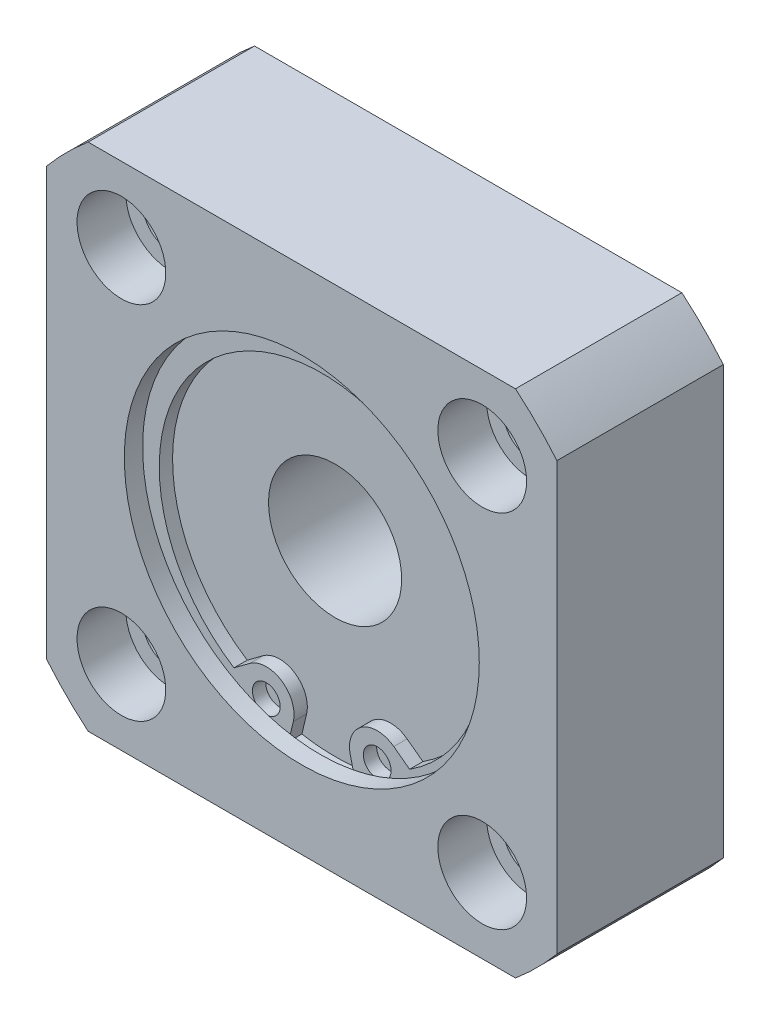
ISO-10303-21;
HEADER;
FILE_DESCRIPTION(('STEP AP214'),'2;1');
FILE_NAME('part.step','',(''),(''),'','','');
FILE_SCHEMA(('AUTOMOTIVE_DESIGN { 1 0 10303 214 1 1 1 1 }'));
ENDSEC;
DATA;
#1=APPLICATION_CONTEXT('core data for automotive mechanical design processes');
#2=APPLICATION_PROTOCOL_DEFINITION('international standard','automotive_design',2000,#1);
#3=PRODUCT_CONTEXT('',#1,'mechanical');
#4=PRODUCT('Part','Part','',(#3));
#5=PRODUCT_RELATED_PRODUCT_CATEGORY('part','',(#4));
#6=PRODUCT_DEFINITION_FORMATION('','',#4);
#7=PRODUCT_DEFINITION_CONTEXT('part definition',#1,'design');
#8=PRODUCT_DEFINITION('design','',#6,#7);
#9=PRODUCT_DEFINITION_SHAPE('','',#8);
#10=(LENGTH_UNIT() NAMED_UNIT(*) SI_UNIT(.MILLI.,.METRE.));
#11=(NAMED_UNIT(*) PLANE_ANGLE_UNIT() SI_UNIT($,.RADIAN.));
#12=(NAMED_UNIT(*) SI_UNIT($,.STERADIAN.) SOLID_ANGLE_UNIT());
#13=UNCERTAINTY_MEASURE_WITH_UNIT(LENGTH_MEASURE(1.E-05),#10,'distance_accuracy_value','');
#14=(GEOMETRIC_REPRESENTATION_CONTEXT(3) GLOBAL_UNCERTAINTY_ASSIGNED_CONTEXT((#13)) GLOBAL_UNIT_ASSIGNED_CONTEXT((#10,
#11,#12)) REPRESENTATION_CONTEXT('',''));
#15=CARTESIAN_POINT('',(0.,0.,0.));
#16=DIRECTION('',(0.,0.,1.));
#17=DIRECTION('',(1.,0.,0.));
#18=AXIS2_PLACEMENT_3D('',#15,#16,#17);
#19=CARTESIAN_POINT('',(0.,0.,12.));
#20=DIRECTION('',(0.,0.,1.));
#21=DIRECTION('',(1.,0.,0.));
#22=AXIS2_PLACEMENT_3D('',#19,#20,#21);
#23=PLANE('',#22);
#24=CARTESIAN_POINT('',(5.,-14.2233767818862,12.));
#25=DIRECTION('',(0.,0.,1.));
#26=DIRECTION('',(1.,0.,0.));
#27=AXIS2_PLACEMENT_3D('',#24,#25,#26);
#28=CIRCLE('',#27,1.25);
#29=CARTESIAN_POINT('',(6.25,-14.2233767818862,12.));
#30=VERTEX_POINT('',#29);
#31=EDGE_CURVE('E169',#30,#30,#28,.T.);
#32=ORIENTED_EDGE('',*,*,#31,.T.);
#33=EDGE_LOOP('',(#32));
#34=FACE_BOUND('',#33,.T.);
#35=ADVANCED_FACE('F14',(#34),#23,.T.);
#36=CARTESIAN_POINT('',(-5.,-14.2233767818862,12.));
#37=DIRECTION('',(0.,0.,-1.));
#38=DIRECTION('',(1.,0.,0.));
#39=AXIS2_PLACEMENT_3D('',#36,#37,#38);
#40=CIRCLE('',#39,1.25);
#41=CARTESIAN_POINT('',(-3.75,-14.2233767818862,12.));
#42=VERTEX_POINT('',#41);
#43=EDGE_CURVE('E179',#42,#42,#40,.T.);
#44=ORIENTED_EDGE('',*,*,#43,.F.);
#45=EDGE_LOOP('',(#44));
#46=FACE_BOUND('',#45,.T.);
#47=ADVANCED_FACE('F377',(#46),#23,.T.);
#48=CARTESIAN_POINT('',(16.2634559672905,16.2634559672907,10.6));
#49=DIRECTION('',(0.,0.,1.));
#50=DIRECTION('',(1.,0.,0.));
#51=AXIS2_PLACEMENT_3D('',#48,#49,#50);
#52=PLANE('',#51);
#53=CARTESIAN_POINT('',(16.2634559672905,16.2634559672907,10.6));
#54=DIRECTION('',(0.,0.,1.));
#55=DIRECTION('',(1.,0.,0.));
#56=AXIS2_PLACEMENT_3D('',#53,#54,#55);
#57=CIRCLE('',#56,4.);
#58=CARTESIAN_POINT('',(20.2634559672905,16.2634559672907,10.6));
#59=VERTEX_POINT('',#58);
#60=EDGE_CURVE('E274',#59,#59,#57,.T.);
#61=ORIENTED_EDGE('',*,*,#60,.T.);
#62=EDGE_LOOP('',(#61));
#63=FACE_BOUND('',#62,.T.);
#64=CARTESIAN_POINT('',(16.2634559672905,16.2634559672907,10.6));
#65=DIRECTION('',(0.,0.,1.));
#66=DIRECTION('',(1.,0.,0.));
#67=AXIS2_PLACEMENT_3D('',#64,#65,#66);
#68=CIRCLE('',#67,2.5);
#69=CARTESIAN_POINT('',(18.7634559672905,16.2634559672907,10.6));
#70=VERTEX_POINT('',#69);
#71=EDGE_CURVE('E277',#70,#70,#68,.F.);
#72=ORIENTED_EDGE('',*,*,#71,.T.);
#73=EDGE_LOOP('',(#72));
#74=FACE_BOUND('',#73,.T.);
#75=ADVANCED_FACE('F385',(#63,#74),#52,.T.);
#76=CARTESIAN_POINT('',(16.2634559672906,-16.2634559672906,10.6));
#77=DIRECTION('',(0.,0.,1.));
#78=DIRECTION('',(0.,-1.,0.));
#79=AXIS2_PLACEMENT_3D('',#76,#77,#78);
#80=PLANE('',#79);
#81=CARTESIAN_POINT('',(16.2634559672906,-16.2634559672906,10.6));
#82=DIRECTION('',(0.,0.,1.));
#83=DIRECTION('',(0.,-1.,0.));
#84=AXIS2_PLACEMENT_3D('',#81,#82,#83);
#85=CIRCLE('',#84,4.);
#86=CARTESIAN_POINT('',(16.2634559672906,-20.2634559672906,10.6));
#87=VERTEX_POINT('',#86);
#88=EDGE_CURVE('E258',#87,#87,#85,.T.);
#89=ORIENTED_EDGE('',*,*,#88,.T.);
#90=EDGE_LOOP('',(#89));
#91=FACE_BOUND('',#90,.T.);
#92=CARTESIAN_POINT('',(16.2634559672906,-16.2634559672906,10.6));
#93=DIRECTION('',(0.,0.,1.));
#94=DIRECTION('',(1.,0.,0.));
#95=AXIS2_PLACEMENT_3D('',#92,#93,#94);
#96=CIRCLE('',#95,2.5);
#97=CARTESIAN_POINT('',(18.7634559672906,-16.2634559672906,10.6));
#98=VERTEX_POINT('',#97);
#99=EDGE_CURVE('E261',#98,#98,#96,.F.);
#100=ORIENTED_EDGE('',*,*,#99,.T.);
#101=EDGE_LOOP('',(#100));
#102=FACE_BOUND('',#101,.T.);
#103=ADVANCED_FACE('F754',(#91,#102),#80,.T.);
#104=CARTESIAN_POINT('',(-16.2634559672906,-16.2634559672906,10.6));
#105=DIRECTION('',(0.,0.,1.));
#106=DIRECTION('',(-1.,0.,0.));
#107=AXIS2_PLACEMENT_3D('',#104,#105,#106);
#108=PLANE('',#107);
#109=CARTESIAN_POINT('',(-16.2634559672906,-16.2634559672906,10.6));
#110=DIRECTION('',(0.,0.,1.));
#111=DIRECTION('',(-1.,0.,0.));
#112=AXIS2_PLACEMENT_3D('',#109,#110,#111);
#113=CIRCLE('',#112,4.);
#114=CARTESIAN_POINT('',(-20.2634559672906,-16.2634559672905,10.6));
#115=VERTEX_POINT('',#114);
#116=EDGE_CURVE('E251',#115,#115,#113,.T.);
#117=ORIENTED_EDGE('',*,*,#116,.T.);
#118=EDGE_LOOP('',(#117));
#119=FACE_BOUND('',#118,.T.);
#120=CARTESIAN_POINT('',(-16.2634559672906,-16.2634559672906,10.6));
#121=DIRECTION('',(0.,0.,1.));
#122=DIRECTION('',(1.,0.,0.));
#123=AXIS2_PLACEMENT_3D('',#120,#121,#122);
#124=CIRCLE('',#123,2.5);
#125=CARTESIAN_POINT('',(-13.7634559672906,-16.2634559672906,10.6));
#126=VERTEX_POINT('',#125);
#127=EDGE_CURVE('E254',#126,#126,#124,.F.);
#128=ORIENTED_EDGE('',*,*,#127,.T.);
#129=EDGE_LOOP('',(#128));
#130=FACE_BOUND('',#129,.T.);
#131=ADVANCED_FACE('F744',(#119,#130),#108,.T.);
#132=CARTESIAN_POINT('',(-16.2634559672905,16.2634559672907,10.6));
#133=DIRECTION('',(0.,0.,1.));
#134=DIRECTION('',(0.,1.,0.));
#135=AXIS2_PLACEMENT_3D('',#132,#133,#134);
#136=PLANE('',#135);
#137=CARTESIAN_POINT('',(-16.2634559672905,16.2634559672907,10.6));
#138=DIRECTION('',(0.,0.,1.));
#139=DIRECTION('',(0.,1.,0.));
#140=AXIS2_PLACEMENT_3D('',#137,#138,#139);
#141=CIRCLE('',#140,4.);
#142=CARTESIAN_POINT('',(-16.2634559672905,20.2634559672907,10.6));
#143=VERTEX_POINT('',#142);
#144=EDGE_CURVE('E244',#143,#143,#141,.T.);
#145=ORIENTED_EDGE('',*,*,#144,.T.);
#146=EDGE_LOOP('',(#145));
#147=FACE_BOUND('',#146,.T.);
#148=CARTESIAN_POINT('',(-16.2634559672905,16.2634559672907,10.6));
#149=DIRECTION('',(0.,0.,1.));
#150=DIRECTION('',(1.,0.,0.));
#151=AXIS2_PLACEMENT_3D('',#148,#149,#150);
#152=CIRCLE('',#151,2.5);
#153=CARTESIAN_POINT('',(-13.7634559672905,16.2634559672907,10.6));
#154=VERTEX_POINT('',#153);
#155=EDGE_CURVE('E247',#154,#154,#152,.F.);
#156=ORIENTED_EDGE('',*,*,#155,.T.);
#157=EDGE_LOOP('',(#156));
#158=FACE_BOUND('',#157,.T.);
#159=ADVANCED_FACE('F734',(#147,#158),#136,.T.);
#160=CARTESIAN_POINT('',(16.2634559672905,16.2634559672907,0.));
#161=DIRECTION('',(0.,0.,1.));
#162=DIRECTION('',(1.,0.,0.));
#163=AXIS2_PLACEMENT_3D('',#160,#161,#162);
#164=CYLINDRICAL_SURFACE('',#163,2.5);
#165=CARTESIAN_POINT('',(16.2634559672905,16.2634559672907,0.));
#166=DIRECTION('',(0.,0.,1.));
#167=DIRECTION('',(1.,0.,0.));
#168=AXIS2_PLACEMENT_3D('',#165,#166,#167);
#169=CIRCLE('',#168,2.5);
#170=CARTESIAN_POINT('',(18.7634559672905,16.2634559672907,0.));
#171=VERTEX_POINT('',#170);
#172=EDGE_CURVE('E278',#171,#171,#169,.T.);
#173=ORIENTED_EDGE('',*,*,#172,.F.);
#174=EDGE_LOOP('',(#173));
#175=FACE_BOUND('',#174,.T.);
#176=ORIENTED_EDGE('',*,*,#71,.F.);
#177=EDGE_LOOP('',(#176));
#178=FACE_BOUND('',#177,.T.);
#179=ADVANCED_FACE('F724',(#175,#178),#164,.F.);
#180=CARTESIAN_POINT('',(16.2634559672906,-16.2634559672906,0.));
#181=DIRECTION('',(0.,0.,1.));
#182=DIRECTION('',(1.,0.,0.));
#183=AXIS2_PLACEMENT_3D('',#180,#181,#182);
#184=CYLINDRICAL_SURFACE('',#183,2.5);
#185=CARTESIAN_POINT('',(16.2634559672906,-16.2634559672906,0.));
#186=DIRECTION('',(0.,0.,1.));
#187=DIRECTION('',(0.,-1.,0.));
#188=AXIS2_PLACEMENT_3D('',#185,#186,#187);
#189=CIRCLE('',#188,2.5);
#190=CARTESIAN_POINT('',(16.2634559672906,-18.7634559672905,0.));
#191=VERTEX_POINT('',#190);
#192=EDGE_CURVE('E268',#191,#191,#189,.T.);
#193=ORIENTED_EDGE('',*,*,#192,.F.);
#194=EDGE_LOOP('',(#193));
#195=FACE_BOUND('',#194,.T.);
#196=ORIENTED_EDGE('',*,*,#99,.F.);
#197=EDGE_LOOP('',(#196));
#198=FACE_BOUND('',#197,.T.);
#199=ADVANCED_FACE('F714',(#195,#198),#184,.F.);
#200=CARTESIAN_POINT('',(-16.2634559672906,-16.2634559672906,0.));
#201=DIRECTION('',(0.,0.,1.));
#202=DIRECTION('',(1.,0.,0.));
#203=AXIS2_PLACEMENT_3D('',#200,#201,#202);
#204=CYLINDRICAL_SURFACE('',#203,2.5);
#205=CARTESIAN_POINT('',(-16.2634559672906,-16.2634559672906,0.));
#206=DIRECTION('',(0.,0.,1.));
#207=DIRECTION('',(-1.,0.,0.));
#208=AXIS2_PLACEMENT_3D('',#205,#206,#207);
#209=CIRCLE('',#208,2.5);
#210=CARTESIAN_POINT('',(-18.7634559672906,-16.2634559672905,0.));
#211=VERTEX_POINT('',#210);
#212=EDGE_CURVE('E265',#211,#211,#209,.T.);
#213=ORIENTED_EDGE('',*,*,#212,.F.);
#214=EDGE_LOOP('',(#213));
#215=FACE_BOUND('',#214,.T.);
#216=ORIENTED_EDGE('',*,*,#127,.F.);
#217=EDGE_LOOP('',(#216));
#218=FACE_BOUND('',#217,.T.);
#219=ADVANCED_FACE('F704',(#215,#218),#204,.F.);
#220=CARTESIAN_POINT('',(-16.2634559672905,16.2634559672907,0.));
#221=DIRECTION('',(0.,0.,1.));
#222=DIRECTION('',(1.,0.,0.));
#223=AXIS2_PLACEMENT_3D('',#220,#221,#222);
#224=CYLINDRICAL_SURFACE('',#223,2.5);
#225=CARTESIAN_POINT('',(-16.2634559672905,16.2634559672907,0.));
#226=DIRECTION('',(0.,0.,1.));
#227=DIRECTION('',(0.,1.,0.));
#228=AXIS2_PLACEMENT_3D('',#225,#226,#227);
#229=CIRCLE('',#228,2.5);
#230=CARTESIAN_POINT('',(-16.2634559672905,18.7634559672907,0.));
#231=VERTEX_POINT('',#230);
#232=EDGE_CURVE('E262',#231,#231,#229,.T.);
#233=ORIENTED_EDGE('',*,*,#232,.F.);
#234=EDGE_LOOP('',(#233));
#235=FACE_BOUND('',#234,.T.);
#236=ORIENTED_EDGE('',*,*,#155,.F.);
#237=EDGE_LOOP('',(#236));
#238=FACE_BOUND('',#237,.T.);
#239=ADVANCED_FACE('F694',(#235,#238),#224,.F.);
#240=CARTESIAN_POINT('',(-19.2613602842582,-23.,15.));
#241=DIRECTION('',(0.,1.,0.));
#242=DIRECTION('',(0.,0.,1.));
#243=AXIS2_PLACEMENT_3D('',#240,#241,#242);
#244=PLANE('',#243);
#245=DIRECTION('',(1.,0.,0.));
#246=VECTOR('',#245,1.);
#247=CARTESIAN_POINT('',(-19.2613602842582,-23.,15.));
#248=LINE('',#247,#246);
#249=CARTESIAN_POINT('',(-19.2613602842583,-23.,15.));
#250=VERTEX_POINT('',#249);
#251=CARTESIAN_POINT('',(19.2613602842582,-23.,15.));
#252=VERTEX_POINT('',#251);
#253=EDGE_CURVE('E306',#250,#252,#248,.T.);
#254=ORIENTED_EDGE('',*,*,#253,.F.);
#255=DIRECTION('',(0.,0.,-1.));
#256=VECTOR('',#255,1.);
#257=CARTESIAN_POINT('',(-19.2613602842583,-23.,15.));
#258=LINE('',#257,#256);
#259=CARTESIAN_POINT('',(-19.2613602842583,-23.,0.));
#260=VERTEX_POINT('',#259);
#261=EDGE_CURVE('E329',#250,#260,#258,.T.);
#262=ORIENTED_EDGE('',*,*,#261,.T.);
#263=DIRECTION('',(1.,0.,0.));
#264=VECTOR('',#263,1.);
#265=CARTESIAN_POINT('',(-19.2613602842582,-23.,0.));
#266=LINE('',#265,#264);
#267=CARTESIAN_POINT('',(19.2613602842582,-23.,0.));
#268=VERTEX_POINT('',#267);
#269=EDGE_CURVE('E284',#260,#268,#266,.T.);
#270=ORIENTED_EDGE('',*,*,#269,.T.);
#271=DIRECTION('',(0.,0.,-1.));
#272=VECTOR('',#271,1.);
#273=CARTESIAN_POINT('',(19.2613602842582,-23.,15.));
#274=LINE('',#273,#272);
#275=EDGE_CURVE('E327',#252,#268,#274,.T.);
#276=ORIENTED_EDGE('',*,*,#275,.F.);
#277=EDGE_LOOP('',(#254,#262,#270,#276));
#278=FACE_BOUND('',#277,.T.);
#279=ADVANCED_FACE('F684',(#278),#244,.F.);
#280=CARTESIAN_POINT('',(0.,0.,15.));
#281=DIRECTION('',(0.,0.,-1.));
#282=DIRECTION('',(-1.,0.,0.));
#283=AXIS2_PLACEMENT_3D('',#280,#281,#282);
#284=CYLINDRICAL_SURFACE('',#283,30.);
#285=ORIENTED_EDGE('',*,*,#261,.F.);
#286=CARTESIAN_POINT('',(0.,0.,15.));
#287=DIRECTION('',(0.,0.,1.));
#288=DIRECTION('',(1.,0.,0.));
#289=AXIS2_PLACEMENT_3D('',#286,#287,#288);
#290=CIRCLE('',#289,30.);
#291=CARTESIAN_POINT('',(-23.,-19.2613602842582,15.));
#292=VERTEX_POINT('',#291);
#293=EDGE_CURVE('E309',#292,#250,#290,.T.);
#294=ORIENTED_EDGE('',*,*,#293,.F.);
#295=DIRECTION('',(0.,0.,-1.));
#296=VECTOR('',#295,1.);
#297=CARTESIAN_POINT('',(-23.,-19.2613602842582,15.));
#298=LINE('',#297,#296);
#299=CARTESIAN_POINT('',(-23.,-19.2613602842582,0.));
#300=VERTEX_POINT('',#299);
#301=EDGE_CURVE('E331',#292,#300,#298,.T.);
#302=ORIENTED_EDGE('',*,*,#301,.T.);
#303=CARTESIAN_POINT('',(0.,0.,0.));
#304=DIRECTION('',(0.,0.,1.));
#305=DIRECTION('',(1.,0.,0.));
#306=AXIS2_PLACEMENT_3D('',#303,#304,#305);
#307=CIRCLE('',#306,30.);
#308=EDGE_CURVE('E287',#300,#260,#307,.T.);
#309=ORIENTED_EDGE('',*,*,#308,.T.);
#310=EDGE_LOOP('',(#285,#294,#302,#309));
#311=FACE_BOUND('',#310,.T.);
#312=ADVANCED_FACE('F674',(#311),#284,.T.);
#313=CARTESIAN_POINT('',(-23.,-19.2613602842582,15.));
#314=DIRECTION('',(-1.,0.,0.));
#315=DIRECTION('',(0.,0.,1.));
#316=AXIS2_PLACEMENT_3D('',#313,#314,#315);
#317=PLANE('',#316);
#318=ORIENTED_EDGE('',*,*,#301,.F.);
#319=DIRECTION('',(0.,1.,0.));
#320=VECTOR('',#319,1.);
#321=CARTESIAN_POINT('',(-23.,-19.2613602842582,15.));
#322=LINE('',#321,#320);
#323=CARTESIAN_POINT('',(-23.,19.2613602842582,15.));
#324=VERTEX_POINT('',#323);
#325=EDGE_CURVE('E312',#292,#324,#322,.T.);
#326=ORIENTED_EDGE('',*,*,#325,.T.);
#327=DIRECTION('',(0.,0.,-1.));
#328=VECTOR('',#327,1.);
#329=CARTESIAN_POINT('',(-23.,19.2613602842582,15.));
#330=LINE('',#329,#328);
#331=CARTESIAN_POINT('',(-23.,19.2613602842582,0.));
#332=VERTEX_POINT('',#331);
#333=EDGE_CURVE('E333',#324,#332,#330,.T.);
#334=ORIENTED_EDGE('',*,*,#333,.T.);
#335=DIRECTION('',(0.,1.,0.));
#336=VECTOR('',#335,1.);
#337=CARTESIAN_POINT('',(-23.,-19.2613602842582,0.));
#338=LINE('',#337,#336);
#339=EDGE_CURVE('E290',#300,#332,#338,.T.);
#340=ORIENTED_EDGE('',*,*,#339,.F.);
#341=EDGE_LOOP('',(#318,#326,#334,#340));
#342=FACE_BOUND('',#341,.T.);
#343=ADVANCED_FACE('F664',(#342),#317,.T.);
#344=CARTESIAN_POINT('',(0.,0.,15.));
#345=DIRECTION('',(0.,0.,-1.));
#346=DIRECTION('',(-1.,0.,0.));
#347=AXIS2_PLACEMENT_3D('',#344,#345,#346);
#348=CYLINDRICAL_SURFACE('',#347,30.);
#349=ORIENTED_EDGE('',*,*,#333,.F.);
#350=CARTESIAN_POINT('',(0.,0.,15.));
#351=DIRECTION('',(0.,0.,-1.));
#352=DIRECTION('',(-1.,0.,0.));
#353=AXIS2_PLACEMENT_3D('',#350,#351,#352);
#354=CIRCLE('',#353,30.);
#355=CARTESIAN_POINT('',(-19.2613602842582,23.,15.));
#356=VERTEX_POINT('',#355);
#357=EDGE_CURVE('E315',#324,#356,#354,.T.);
#358=ORIENTED_EDGE('',*,*,#357,.T.);
#359=DIRECTION('',(0.,0.,-1.));
#360=VECTOR('',#359,1.);
#361=CARTESIAN_POINT('',(-19.2613602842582,23.,15.));
#362=LINE('',#361,#360);
#363=CARTESIAN_POINT('',(-19.2613602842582,23.,0.));
#364=VERTEX_POINT('',#363);
#365=EDGE_CURVE('E335',#356,#364,#362,.T.);
#366=ORIENTED_EDGE('',*,*,#365,.T.);
#367=CARTESIAN_POINT('',(0.,0.,0.));
#368=DIRECTION('',(0.,0.,-1.));
#369=DIRECTION('',(-1.,0.,0.));
#370=AXIS2_PLACEMENT_3D('',#367,#368,#369);
#371=CIRCLE('',#370,30.);
#372=EDGE_CURVE('E293',#332,#364,#371,.T.);
#373=ORIENTED_EDGE('',*,*,#372,.F.);
#374=EDGE_LOOP('',(#349,#358,#366,#373));
#375=FACE_BOUND('',#374,.T.);
#376=ADVANCED_FACE('F654',(#375),#348,.T.);
#377=CARTESIAN_POINT('',(-19.2613602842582,23.,15.));
#378=DIRECTION('',(0.,1.,0.));
#379=DIRECTION('',(0.,0.,1.));
#380=AXIS2_PLACEMENT_3D('',#377,#378,#379);
#381=PLANE('',#380);
#382=ORIENTED_EDGE('',*,*,#365,.F.);
#383=DIRECTION('',(1.,0.,0.));
#384=VECTOR('',#383,1.);
#385=CARTESIAN_POINT('',(-19.2613602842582,23.,15.));
#386=LINE('',#385,#384);
#387=CARTESIAN_POINT('',(19.2613602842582,23.,15.));
#388=VERTEX_POINT('',#387);
#389=EDGE_CURVE('E318',#356,#388,#386,.T.);
#390=ORIENTED_EDGE('',*,*,#389,.T.);
#391=DIRECTION('',(0.,0.,-1.));
#392=VECTOR('',#391,1.);
#393=CARTESIAN_POINT('',(19.2613602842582,23.,15.));
#394=LINE('',#393,#392);
#395=CARTESIAN_POINT('',(19.2613602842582,23.,0.));
#396=VERTEX_POINT('',#395);
#397=EDGE_CURVE('E337',#388,#396,#394,.T.);
#398=ORIENTED_EDGE('',*,*,#397,.T.);
#399=DIRECTION('',(1.,0.,0.));
#400=VECTOR('',#399,1.);
#401=CARTESIAN_POINT('',(-19.2613602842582,23.,0.));
#402=LINE('',#401,#400);
#403=EDGE_CURVE('E296',#364,#396,#402,.T.);
#404=ORIENTED_EDGE('',*,*,#403,.F.);
#405=EDGE_LOOP('',(#382,#390,#398,#404));
#406=FACE_BOUND('',#405,.T.);
#407=ADVANCED_FACE('F645',(#406),#381,.T.);
#408=CARTESIAN_POINT('',(0.,0.,15.));
#409=DIRECTION('',(0.,0.,-1.));
#410=DIRECTION('',(-1.,0.,0.));
#411=AXIS2_PLACEMENT_3D('',#408,#409,#410);
#412=CYLINDRICAL_SURFACE('',#411,30.);
#413=ORIENTED_EDGE('',*,*,#397,.F.);
#414=CARTESIAN_POINT('',(0.,0.,15.));
#415=DIRECTION('',(0.,0.,1.));
#416=DIRECTION('',(1.,0.,0.));
#417=AXIS2_PLACEMENT_3D('',#414,#415,#416);
#418=CIRCLE('',#417,30.);
#419=CARTESIAN_POINT('',(23.,19.2613602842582,15.));
#420=VERTEX_POINT('',#419);
#421=EDGE_CURVE('E321',#420,#388,#418,.T.);
#422=ORIENTED_EDGE('',*,*,#421,.F.);
#423=DIRECTION('',(0.,0.,-1.));
#424=VECTOR('',#423,1.);
#425=CARTESIAN_POINT('',(23.,19.2613602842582,15.));
#426=LINE('',#425,#424);
#427=CARTESIAN_POINT('',(23.,19.2613602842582,0.));
#428=VERTEX_POINT('',#427);
#429=EDGE_CURVE('E82',#420,#428,#426,.T.);
#430=ORIENTED_EDGE('',*,*,#429,.T.);
#431=CARTESIAN_POINT('',(0.,0.,0.));
#432=DIRECTION('',(0.,0.,1.));
#433=DIRECTION('',(1.,0.,0.));
#434=AXIS2_PLACEMENT_3D('',#431,#432,#433);
#435=CIRCLE('',#434,30.);
#436=EDGE_CURVE('E299',#428,#396,#435,.T.);
#437=ORIENTED_EDGE('',*,*,#436,.T.);
#438=EDGE_LOOP('',(#413,#422,#430,#437));
#439=FACE_BOUND('',#438,.T.);
#440=ADVANCED_FACE('F637',(#439),#412,.T.);
#441=CARTESIAN_POINT('',(23.,-19.2613602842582,15.));
#442=DIRECTION('',(-1.,0.,0.));
#443=DIRECTION('',(0.,0.,1.));
#444=AXIS2_PLACEMENT_3D('',#441,#442,#443);
#445=PLANE('',#444);
#446=ORIENTED_EDGE('',*,*,#429,.F.);
#447=DIRECTION('',(0.,1.,0.));
#448=VECTOR('',#447,1.);
#449=CARTESIAN_POINT('',(23.,-19.2613602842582,15.));
#450=LINE('',#449,#448);
#451=CARTESIAN_POINT('',(23.,-19.2613602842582,15.));
#452=VERTEX_POINT('',#451);
#453=EDGE_CURVE('E324',#452,#420,#450,.T.);
#454=ORIENTED_EDGE('',*,*,#453,.F.);
#455=DIRECTION('',(0.,0.,-1.));
#456=VECTOR('',#455,1.);
#457=CARTESIAN_POINT('',(23.,-19.2613602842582,15.));
#458=LINE('',#457,#456);
#459=CARTESIAN_POINT('',(23.,-19.2613602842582,0.));
#460=VERTEX_POINT('',#459);
#461=EDGE_CURVE('E89',#452,#460,#458,.T.);
#462=ORIENTED_EDGE('',*,*,#461,.T.);
#463=DIRECTION('',(0.,1.,0.));
#464=VECTOR('',#463,1.);
#465=CARTESIAN_POINT('',(23.,-19.2613602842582,0.));
#466=LINE('',#465,#464);
#467=EDGE_CURVE('E302',#460,#428,#466,.T.);
#468=ORIENTED_EDGE('',*,*,#467,.T.);
#469=EDGE_LOOP('',(#446,#454,#462,#468));
#470=FACE_BOUND('',#469,.T.);
#471=ADVANCED_FACE('F16',(#470),#445,.F.);
#472=CARTESIAN_POINT('',(0.,0.,15.));
#473=DIRECTION('',(0.,0.,-1.));
#474=DIRECTION('',(-1.,0.,0.));
#475=AXIS2_PLACEMENT_3D('',#472,#473,#474);
#476=CYLINDRICAL_SURFACE('',#475,30.);
#477=ORIENTED_EDGE('',*,*,#461,.F.);
#478=CARTESIAN_POINT('',(0.,0.,15.));
#479=DIRECTION('',(0.,0.,-1.));
#480=DIRECTION('',(-1.,0.,0.));
#481=AXIS2_PLACEMENT_3D('',#478,#479,#480);
#482=CIRCLE('',#481,30.);
#483=EDGE_CURVE('E304',#452,#252,#482,.T.);
#484=ORIENTED_EDGE('',*,*,#483,.T.);
#485=ORIENTED_EDGE('',*,*,#275,.T.);
#486=CARTESIAN_POINT('',(0.,0.,0.));
#487=DIRECTION('',(0.,0.,-1.));
#488=DIRECTION('',(-1.,0.,0.));
#489=AXIS2_PLACEMENT_3D('',#486,#487,#488);
#490=CIRCLE('',#489,30.);
#491=EDGE_CURVE('E281',#460,#268,#490,.T.);
#492=ORIENTED_EDGE('',*,*,#491,.F.);
#493=EDGE_LOOP('',(#477,#484,#485,#492));
#494=FACE_BOUND('',#493,.T.);
#495=ADVANCED_FACE('F619',(#494),#476,.T.);
#496=CARTESIAN_POINT('',(16.2634559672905,16.2634559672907,10.6));
#497=DIRECTION('',(0.,0.,1.));
#498=DIRECTION('',(1.,0.,0.));
#499=AXIS2_PLACEMENT_3D('',#496,#497,#498);
#500=CYLINDRICAL_SURFACE('',#499,4.);
#501=ORIENTED_EDGE('',*,*,#60,.F.);
#502=EDGE_LOOP('',(#501));
#503=FACE_BOUND('',#502,.T.);
#504=CARTESIAN_POINT('',(16.2634559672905,16.2634559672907,15.));
#505=DIRECTION('',(0.,0.,1.));
#506=DIRECTION('',(1.,0.,0.));
#507=AXIS2_PLACEMENT_3D('',#504,#505,#506);
#508=CIRCLE('',#507,4.);
#509=CARTESIAN_POINT('',(20.2634559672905,16.2634559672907,15.));
#510=VERTEX_POINT('',#509);
#511=EDGE_CURVE('E271',#510,#510,#508,.T.);
#512=ORIENTED_EDGE('',*,*,#511,.T.);
#513=EDGE_LOOP('',(#512));
#514=FACE_BOUND('',#513,.T.);
#515=ADVANCED_FACE('F609',(#503,#514),#500,.F.);
#516=CARTESIAN_POINT('',(16.2634559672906,-16.2634559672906,10.6));
#517=DIRECTION('',(0.,0.,1.));
#518=DIRECTION('',(1.,0.,0.));
#519=AXIS2_PLACEMENT_3D('',#516,#517,#518);
#520=CYLINDRICAL_SURFACE('',#519,4.);
#521=ORIENTED_EDGE('',*,*,#88,.F.);
#522=EDGE_LOOP('',(#521));
#523=FACE_BOUND('',#522,.T.);
#524=CARTESIAN_POINT('',(16.2634559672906,-16.2634559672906,15.));
#525=DIRECTION('',(0.,0.,1.));
#526=DIRECTION('',(0.,-1.,0.));
#527=AXIS2_PLACEMENT_3D('',#524,#525,#526);
#528=CIRCLE('',#527,4.);
#529=CARTESIAN_POINT('',(16.2634559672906,-20.2634559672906,15.));
#530=VERTEX_POINT('',#529);
#531=EDGE_CURVE('E255',#530,#530,#528,.T.);
#532=ORIENTED_EDGE('',*,*,#531,.T.);
#533=EDGE_LOOP('',(#532));
#534=FACE_BOUND('',#533,.T.);
#535=ADVANCED_FACE('F599',(#523,#534),#520,.F.);
#536=CARTESIAN_POINT('',(-16.2634559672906,-16.2634559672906,10.6));
#537=DIRECTION('',(0.,0.,1.));
#538=DIRECTION('',(1.,0.,0.));
#539=AXIS2_PLACEMENT_3D('',#536,#537,#538);
#540=CYLINDRICAL_SURFACE('',#539,4.);
#541=ORIENTED_EDGE('',*,*,#116,.F.);
#542=EDGE_LOOP('',(#541));
#543=FACE_BOUND('',#542,.T.);
#544=CARTESIAN_POINT('',(-16.2634559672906,-16.2634559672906,15.));
#545=DIRECTION('',(0.,0.,1.));
#546=DIRECTION('',(-1.,0.,0.));
#547=AXIS2_PLACEMENT_3D('',#544,#545,#546);
#548=CIRCLE('',#547,4.);
#549=CARTESIAN_POINT('',(-20.2634559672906,-16.2634559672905,15.));
#550=VERTEX_POINT('',#549);
#551=EDGE_CURVE('E248',#550,#550,#548,.T.);
#552=ORIENTED_EDGE('',*,*,#551,.T.);
#553=EDGE_LOOP('',(#552));
#554=FACE_BOUND('',#553,.T.);
#555=ADVANCED_FACE('F589',(#543,#554),#540,.F.);
#556=CARTESIAN_POINT('',(-16.2634559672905,16.2634559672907,10.6));
#557=DIRECTION('',(0.,0.,1.));
#558=DIRECTION('',(1.,0.,0.));
#559=AXIS2_PLACEMENT_3D('',#556,#557,#558);
#560=CYLINDRICAL_SURFACE('',#559,4.);
#561=ORIENTED_EDGE('',*,*,#144,.F.);
#562=EDGE_LOOP('',(#561));
#563=FACE_BOUND('',#562,.T.);
#564=CARTESIAN_POINT('',(-16.2634559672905,16.2634559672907,15.));
#565=DIRECTION('',(0.,0.,1.));
#566=DIRECTION('',(0.,1.,0.));
#567=AXIS2_PLACEMENT_3D('',#564,#565,#566);
#568=CIRCLE('',#567,4.);
#569=CARTESIAN_POINT('',(-16.2634559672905,20.2634559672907,15.));
#570=VERTEX_POINT('',#569);
#571=EDGE_CURVE('E241',#570,#570,#568,.T.);
#572=ORIENTED_EDGE('',*,*,#571,.T.);
#573=EDGE_LOOP('',(#572));
#574=FACE_BOUND('',#573,.T.);
#575=ADVANCED_FACE('F579',(#563,#574),#560,.F.);
#576=CARTESIAN_POINT('',(0.,0.,0.));
#577=DIRECTION('',(0.,0.,-1.));
#578=DIRECTION('',(-1.,0.,0.));
#579=AXIS2_PLACEMENT_3D('',#576,#577,#578);
#580=PLANE('',#579);
#581=CARTESIAN_POINT('',(0.,0.,0.));
#582=DIRECTION('',(0.,0.,-1.));
#583=DIRECTION('',(-1.,0.,0.));
#584=AXIS2_PLACEMENT_3D('',#581,#582,#583);
#585=CIRCLE('',#584,13.);
#586=CARTESIAN_POINT('',(-13.,0.,0.));
#587=VERTEX_POINT('',#586);
#588=EDGE_CURVE('E230',#587,#587,#585,.T.);
#589=ORIENTED_EDGE('',*,*,#588,.F.);
#590=EDGE_LOOP('',(#589));
#591=FACE_BOUND('',#590,.T.);
#592=ORIENTED_EDGE('',*,*,#232,.T.);
#593=EDGE_LOOP('',(#592));
#594=FACE_BOUND('',#593,.T.);
#595=ORIENTED_EDGE('',*,*,#212,.T.);
#596=EDGE_LOOP('',(#595));
#597=FACE_BOUND('',#596,.T.);
#598=ORIENTED_EDGE('',*,*,#192,.T.);
#599=EDGE_LOOP('',(#598));
#600=FACE_BOUND('',#599,.T.);
#601=ORIENTED_EDGE('',*,*,#172,.T.);
#602=EDGE_LOOP('',(#601));
#603=FACE_BOUND('',#602,.T.);
#604=ORIENTED_EDGE('',*,*,#491,.T.);
#605=ORIENTED_EDGE('',*,*,#269,.F.);
#606=ORIENTED_EDGE('',*,*,#308,.F.);
#607=ORIENTED_EDGE('',*,*,#339,.T.);
#608=ORIENTED_EDGE('',*,*,#372,.T.);
#609=ORIENTED_EDGE('',*,*,#403,.T.);
#610=ORIENTED_EDGE('',*,*,#436,.F.);
#611=ORIENTED_EDGE('',*,*,#467,.F.);
#612=EDGE_LOOP('',(#604,#605,#606,#607,#608,#609,#610,#611));
#613=FACE_BOUND('',#612,.T.);
#614=ADVANCED_FACE('F569',(#591,#594,#597,#600,#603,#613),#580,.T.);
#615=CARTESIAN_POINT('',(0.,0.,15.));
#616=DIRECTION('',(0.,0.,-1.));
#617=DIRECTION('',(-1.,0.,0.));
#618=AXIS2_PLACEMENT_3D('',#615,#616,#617);
#619=PLANE('',#618);
#620=CARTESIAN_POINT('',(0.,0.,15.));
#621=DIRECTION('',(0.,0.,1.));
#622=DIRECTION('',(1.,0.,0.));
#623=AXIS2_PLACEMENT_3D('',#620,#621,#622);
#624=CIRCLE('',#623,16.);
#625=CARTESIAN_POINT('',(16.,0.,15.));
#626=VERTEX_POINT('',#625);
#627=EDGE_CURVE('E237',#626,#626,#624,.T.);
#628=ORIENTED_EDGE('',*,*,#627,.F.);
#629=EDGE_LOOP('',(#628));
#630=FACE_BOUND('',#629,.T.);
#631=ORIENTED_EDGE('',*,*,#571,.F.);
#632=EDGE_LOOP('',(#631));
#633=FACE_BOUND('',#632,.T.);
#634=ORIENTED_EDGE('',*,*,#551,.F.);
#635=EDGE_LOOP('',(#634));
#636=FACE_BOUND('',#635,.T.);
#637=ORIENTED_EDGE('',*,*,#531,.F.);
#638=EDGE_LOOP('',(#637));
#639=FACE_BOUND('',#638,.T.);
#640=ORIENTED_EDGE('',*,*,#511,.F.);
#641=EDGE_LOOP('',(#640));
#642=FACE_BOUND('',#641,.T.);
#643=ORIENTED_EDGE('',*,*,#483,.F.);
#644=ORIENTED_EDGE('',*,*,#453,.T.);
#645=ORIENTED_EDGE('',*,*,#421,.T.);
#646=ORIENTED_EDGE('',*,*,#389,.F.);
#647=ORIENTED_EDGE('',*,*,#357,.F.);
#648=ORIENTED_EDGE('',*,*,#325,.F.);
#649=ORIENTED_EDGE('',*,*,#293,.T.);
#650=ORIENTED_EDGE('',*,*,#253,.T.);
#651=EDGE_LOOP('',(#643,#644,#645,#646,#647,#648,#649,#650));
#652=FACE_BOUND('',#651,.T.);
#653=ADVANCED_FACE('F560',(#630,#633,#636,#639,#642,#652),#619,.F.);
#654=CARTESIAN_POINT('',(0.,0.,2.));
#655=DIRECTION('',(0.,0.,-1.));
#656=DIRECTION('',(-1.,0.,0.));
#657=AXIS2_PLACEMENT_3D('',#654,#655,#656);
#658=CYLINDRICAL_SURFACE('',#657,13.);
#659=CARTESIAN_POINT('',(0.,0.,2.));
#660=DIRECTION('',(0.,0.,-1.));
#661=DIRECTION('',(-1.,0.,0.));
#662=AXIS2_PLACEMENT_3D('',#659,#660,#661);
#663=CIRCLE('',#662,13.);
#664=CARTESIAN_POINT('',(-13.,0.,2.));
#665=VERTEX_POINT('',#664);
#666=EDGE_CURVE('E233',#665,#665,#663,.T.);
#667=ORIENTED_EDGE('',*,*,#666,.F.);
#668=EDGE_LOOP('',(#667));
#669=FACE_BOUND('',#668,.T.);
#670=ORIENTED_EDGE('',*,*,#588,.T.);
#671=EDGE_LOOP('',(#670));
#672=FACE_BOUND('',#671,.T.);
#673=ADVANCED_FACE('F552',(#669,#672),#658,.F.);
#674=CARTESIAN_POINT('',(0.,0.,12.));
#675=DIRECTION('',(0.,0.,1.));
#676=DIRECTION('',(1.,0.,0.));
#677=AXIS2_PLACEMENT_3D('',#674,#675,#676);
#678=CYLINDRICAL_SURFACE('',#677,16.);
#679=CARTESIAN_POINT('',(0.,0.,13.35));
#680=DIRECTION('',(0.,0.,1.));
#681=DIRECTION('',(1.,0.,0.));
#682=AXIS2_PLACEMENT_3D('',#679,#680,#681);
#683=CIRCLE('',#682,16.);
#684=CARTESIAN_POINT('',(16.,0.,13.35));
#685=VERTEX_POINT('',#684);
#686=EDGE_CURVE('E228',#685,#685,#683,.F.);
#687=ORIENTED_EDGE('',*,*,#686,.T.);
#688=EDGE_LOOP('',(#687));
#689=FACE_BOUND('',#688,.T.);
#690=ORIENTED_EDGE('',*,*,#627,.T.);
#691=EDGE_LOOP('',(#690));
#692=FACE_BOUND('',#691,.T.);
#693=ADVANCED_FACE('F356',(#689,#692),#678,.F.);
#694=CARTESIAN_POINT('',(0.,0.,2.));
#695=DIRECTION('',(0.,0.,-1.));
#696=DIRECTION('',(-1.,0.,0.));
#697=AXIS2_PLACEMENT_3D('',#694,#695,#696);
#698=PLANE('',#697);
#699=CARTESIAN_POINT('',(0.,0.,2.));
#700=DIRECTION('',(0.,0.,-1.));
#701=DIRECTION('',(-1.,0.,0.));
#702=AXIS2_PLACEMENT_3D('',#699,#700,#701);
#703=CIRCLE('',#702,6.);
#704=CARTESIAN_POINT('',(-6.,0.,2.));
#705=VERTEX_POINT('',#704);
#706=EDGE_CURVE('E236',#705,#705,#703,.T.);
#707=ORIENTED_EDGE('',*,*,#706,.F.);
#708=EDGE_LOOP('',(#707));
#709=FACE_BOUND('',#708,.T.);
#710=ORIENTED_EDGE('',*,*,#666,.T.);
#711=EDGE_LOOP('',(#710));
#712=FACE_BOUND('',#711,.T.);
#713=ADVANCED_FACE('F361',(#709,#712),#698,.T.);
#714=CARTESIAN_POINT('',(0.,0.,13.35));
#715=DIRECTION('',(0.,0.,1.));
#716=DIRECTION('',(1.,0.,0.));
#717=AXIS2_PLACEMENT_3D('',#714,#715,#716);
#718=PLANE('',#717);
#719=CARTESIAN_POINT('',(0.,0.,13.35));
#720=DIRECTION('',(0.,0.,1.));
#721=DIRECTION('',(1.,0.,0.));
#722=AXIS2_PLACEMENT_3D('',#719,#720,#721);
#723=CIRCLE('',#722,16.85);
#724=CARTESIAN_POINT('',(16.85,0.,13.35));
#725=VERTEX_POINT('',#724);
#726=EDGE_CURVE('E225',#725,#725,#723,.T.);
#727=ORIENTED_EDGE('',*,*,#726,.F.);
#728=EDGE_LOOP('',(#727));
#729=FACE_BOUND('',#728,.T.);
#730=ORIENTED_EDGE('',*,*,#686,.F.);
#731=EDGE_LOOP('',(#730));
#732=FACE_BOUND('',#731,.T.);
#733=ADVANCED_FACE('F359',(#729,#732),#718,.F.);
#734=CARTESIAN_POINT('',(0.,0.,13.35));
#735=DIRECTION('',(0.,0.,-1.));
#736=DIRECTION('',(-1.,0.,0.));
#737=AXIS2_PLACEMENT_3D('',#734,#735,#736);
#738=CYLINDRICAL_SURFACE('',#737,16.85);
#739=ORIENTED_EDGE('',*,*,#726,.T.);
#740=EDGE_LOOP('',(#739));
#741=FACE_BOUND('',#740,.T.);
#742=DIRECTION('',(0.,0.,-1.));
#743=VECTOR('',#742,1.);
#744=CARTESIAN_POINT('',(2.99125499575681,-16.5823669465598,13.35));
#745=LINE('',#744,#743);
#746=CARTESIAN_POINT('',(2.99125499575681,-16.5823669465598,12.));
#747=VERTEX_POINT('',#746);
#748=CARTESIAN_POINT('',(2.99125499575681,-16.5823669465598,13.2));
#749=VERTEX_POINT('',#748);
#750=EDGE_CURVE('E18',#747,#749,#745,.F.);
#751=ORIENTED_EDGE('',*,*,#750,.F.);
#752=CARTESIAN_POINT('',(0.,0.,12.));
#753=DIRECTION('',(0.,0.,1.));
#754=DIRECTION('',(1.,0.,0.));
#755=AXIS2_PLACEMENT_3D('',#752,#753,#754);
#756=CIRCLE('',#755,16.85);
#757=CARTESIAN_POINT('',(-2.99125499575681,-16.5823669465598,12.));
#758=VERTEX_POINT('',#757);
#759=EDGE_CURVE('E137',#758,#747,#756,.T.);
#760=ORIENTED_EDGE('',*,*,#759,.F.);
#761=DIRECTION('',(0.,0.,-1.));
#762=VECTOR('',#761,1.);
#763=CARTESIAN_POINT('',(-2.99125499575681,-16.5823669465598,13.35));
#764=LINE('',#763,#762);
#765=CARTESIAN_POINT('',(-2.99125499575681,-16.5823669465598,13.2));
#766=VERTEX_POINT('',#765);
#767=EDGE_CURVE('E134',#766,#758,#764,.T.);
#768=ORIENTED_EDGE('',*,*,#767,.F.);
#769=CARTESIAN_POINT('',(0.,0.,13.2));
#770=DIRECTION('',(0.,0.,-1.));
#771=DIRECTION('',(-1.,0.,0.));
#772=AXIS2_PLACEMENT_3D('',#769,#770,#771);
#773=CIRCLE('',#772,16.85);
#774=EDGE_CURVE('E9',#749,#766,#773,.F.);
#775=ORIENTED_EDGE('',*,*,#774,.F.);
#776=EDGE_LOOP('',(#751,#760,#768,#775));
#777=FACE_BOUND('',#776,.T.);
#778=ADVANCED_FACE('F135',(#741,#777),#738,.F.);
#779=CARTESIAN_POINT('',(0.,0.,15.));
#780=DIRECTION('',(0.,0.,-1.));
#781=DIRECTION('',(-1.,0.,0.));
#782=AXIS2_PLACEMENT_3D('',#779,#780,#781);
#783=CYLINDRICAL_SURFACE('',#782,6.);
#784=CARTESIAN_POINT('',(0.,0.,12.));
#785=DIRECTION('',(0.,0.,1.));
#786=DIRECTION('',(1.,0.,0.));
#787=AXIS2_PLACEMENT_3D('',#784,#785,#786);
#788=CIRCLE('',#787,6.);
#789=CARTESIAN_POINT('',(6.,0.,12.));
#790=VERTEX_POINT('',#789);
#791=EDGE_CURVE('E240',#790,#790,#788,.T.);
#792=ORIENTED_EDGE('',*,*,#791,.T.);
#793=EDGE_LOOP('',(#792));
#794=FACE_BOUND('',#793,.T.);
#795=ORIENTED_EDGE('',*,*,#706,.T.);
#796=EDGE_LOOP('',(#795));
#797=FACE_BOUND('',#796,.T.);
#798=ADVANCED_FACE('F369',(#794,#797),#783,.F.);
#799=ORIENTED_EDGE('',*,*,#791,.F.);
#800=EDGE_LOOP('',(#799));
#801=FACE_BOUND('',#800,.T.);
#802=DIRECTION('',(0.231349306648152,-0.972870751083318,0.));
#803=VECTOR('',#802,1.);
#804=CARTESIAN_POINT('',(2.5678231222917,-14.8017500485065,12.));
#805=LINE('',#804,#803);
#806=CARTESIAN_POINT('',(2.5678231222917,-14.8017500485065,12.));
#807=VERTEX_POINT('',#806);
#808=EDGE_CURVE('E185',#807,#747,#805,.T.);
#809=ORIENTED_EDGE('',*,*,#808,.F.);
#810=CARTESIAN_POINT('',(5.,-14.2233767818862,12.));
#811=DIRECTION('',(0.,0.,1.));
#812=DIRECTION('',(1.,0.,0.));
#813=AXIS2_PLACEMENT_3D('',#810,#811,#812);
#814=CIRCLE('',#813,2.5);
#815=CARTESIAN_POINT('',(6.49138441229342,-12.2169439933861,12.));
#816=VERTEX_POINT('',#815);
#817=EDGE_CURVE('E184',#816,#807,#814,.T.);
#818=ORIENTED_EDGE('',*,*,#817,.F.);
#819=DIRECTION('',(-0.802573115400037,0.596553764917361,0.));
#820=VECTOR('',#819,1.);
#821=CARTESIAN_POINT('',(6.49138441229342,-12.2169439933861,12.));
#822=LINE('',#821,#820);
#823=CARTESIAN_POINT('',(7.91695293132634,-13.2765711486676,12.));
#824=VERTEX_POINT('',#823);
#825=EDGE_CURVE('E197',#824,#816,#822,.T.);
#826=ORIENTED_EDGE('',*,*,#825,.F.);
#827=CARTESIAN_POINT('',(0.,-0.95,12.));
#828=DIRECTION('',(0.,0.,-1.));
#829=DIRECTION('',(0.,-1.,0.));
#830=AXIS2_PLACEMENT_3D('',#827,#828,#829);
#831=CIRCLE('',#830,14.65);
#832=CARTESIAN_POINT('',(-7.91695293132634,-13.2765711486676,12.));
#833=VERTEX_POINT('',#832);
#834=EDGE_CURVE('E166',#833,#824,#831,.T.);
#835=ORIENTED_EDGE('',*,*,#834,.F.);
#836=DIRECTION('',(-0.802573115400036,-0.596553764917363,0.));
#837=VECTOR('',#836,1.);
#838=CARTESIAN_POINT('',(-6.49138441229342,-12.2169439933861,12.));
#839=LINE('',#838,#837);
#840=CARTESIAN_POINT('',(-6.49138441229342,-12.2169439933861,12.));
#841=VERTEX_POINT('',#840);
#842=EDGE_CURVE('E140',#841,#833,#839,.T.);
#843=ORIENTED_EDGE('',*,*,#842,.F.);
#844=CARTESIAN_POINT('',(-5.,-14.2233767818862,12.));
#845=DIRECTION('',(0.,0.,1.));
#846=DIRECTION('',(-1.,0.,0.));
#847=AXIS2_PLACEMENT_3D('',#844,#845,#846);
#848=CIRCLE('',#847,2.5);
#849=CARTESIAN_POINT('',(-2.56782312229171,-14.8017500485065,12.));
#850=VERTEX_POINT('',#849);
#851=EDGE_CURVE('E164',#850,#841,#848,.T.);
#852=ORIENTED_EDGE('',*,*,#851,.F.);
#853=DIRECTION('',(0.231349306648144,0.97287075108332,0.));
#854=VECTOR('',#853,1.);
#855=CARTESIAN_POINT('',(-2.56782312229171,-14.8017500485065,12.));
#856=LINE('',#855,#854);
#857=EDGE_CURVE('E203',#758,#850,#856,.T.);
#858=ORIENTED_EDGE('',*,*,#857,.F.);
#859=ORIENTED_EDGE('',*,*,#759,.T.);
#860=EDGE_LOOP('',(#809,#818,#826,#835,#843,#852,#858,#859));
#861=FACE_BOUND('',#860,.T.);
#862=ADVANCED_FACE('F380',(#801,#861),#23,.T.);
#863=CARTESIAN_POINT('',(0.,-0.95,13.2));
#864=DIRECTION('',(0.,0.,1.));
#865=DIRECTION('',(-1.,0.,0.));
#866=AXIS2_PLACEMENT_3D('',#863,#864,#865);
#867=CYLINDRICAL_SURFACE('',#866,14.65);
#868=ORIENTED_EDGE('',*,*,#834,.T.);
#869=DIRECTION('',(0.,0.,-1.));
#870=VECTOR('',#869,1.);
#871=CARTESIAN_POINT('',(7.91695293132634,-13.2765711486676,13.2));
#872=LINE('',#871,#870);
#873=CARTESIAN_POINT('',(7.91695293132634,-13.2765711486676,13.2));
#874=VERTEX_POINT('',#873);
#875=EDGE_CURVE('E175',#874,#824,#872,.T.);
#876=ORIENTED_EDGE('',*,*,#875,.F.);
#877=CARTESIAN_POINT('',(0.,-0.95,13.2));
#878=DIRECTION('',(0.,0.,-1.));
#879=DIRECTION('',(0.,-1.,0.));
#880=AXIS2_PLACEMENT_3D('',#877,#878,#879);
#881=CIRCLE('',#880,14.65);
#882=CARTESIAN_POINT('',(-7.91695293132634,-13.2765711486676,13.2));
#883=VERTEX_POINT('',#882);
#884=EDGE_CURVE('E176',#883,#874,#881,.T.);
#885=ORIENTED_EDGE('',*,*,#884,.F.);
#886=DIRECTION('',(0.,0.,-1.));
#887=VECTOR('',#886,1.);
#888=CARTESIAN_POINT('',(-7.91695293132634,-13.2765711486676,13.2));
#889=LINE('',#888,#887);
#890=EDGE_CURVE('E170',#883,#833,#889,.T.);
#891=ORIENTED_EDGE('',*,*,#890,.T.);
#892=EDGE_LOOP('',(#868,#876,#885,#891));
#893=FACE_BOUND('',#892,.T.);
#894=ADVANCED_FACE('F381',(#893),#867,.F.);
#895=CARTESIAN_POINT('',(6.49138441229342,-12.2169439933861,13.2));
#896=DIRECTION('',(-0.596553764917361,-0.802573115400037,0.));
#897=DIRECTION('',(-0.802573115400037,0.596553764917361,0.));
#898=AXIS2_PLACEMENT_3D('',#895,#896,#897);
#899=PLANE('',#898);
#900=ORIENTED_EDGE('',*,*,#825,.T.);
#901=DIRECTION('',(0.,0.,-1.));
#902=VECTOR('',#901,1.);
#903=CARTESIAN_POINT('',(6.49138441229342,-12.2169439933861,13.2));
#904=LINE('',#903,#902);
#905=CARTESIAN_POINT('',(6.49138441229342,-12.2169439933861,13.2));
#906=VERTEX_POINT('',#905);
#907=EDGE_CURVE('E180',#906,#816,#904,.T.);
#908=ORIENTED_EDGE('',*,*,#907,.F.);
#909=DIRECTION('',(-0.802573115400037,0.596553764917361,0.));
#910=VECTOR('',#909,1.);
#911=CARTESIAN_POINT('',(6.49138441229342,-12.2169439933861,13.2));
#912=LINE('',#911,#910);
#913=EDGE_CURVE('E186',#874,#906,#912,.T.);
#914=ORIENTED_EDGE('',*,*,#913,.F.);
#915=ORIENTED_EDGE('',*,*,#875,.T.);
#916=EDGE_LOOP('',(#900,#908,#914,#915));
#917=FACE_BOUND('',#916,.T.);
#918=ADVANCED_FACE('F393',(#917),#899,.F.);
#919=CARTESIAN_POINT('',(5.,-14.2233767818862,13.2));
#920=DIRECTION('',(0.,0.,1.));
#921=DIRECTION('',(-1.,0.,0.));
#922=AXIS2_PLACEMENT_3D('',#919,#920,#921);
#923=CYLINDRICAL_SURFACE('',#922,2.5);
#924=ORIENTED_EDGE('',*,*,#817,.T.);
#925=DIRECTION('',(0.,0.,-1.));
#926=VECTOR('',#925,1.);
#927=CARTESIAN_POINT('',(2.5678231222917,-14.8017500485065,13.2));
#928=LINE('',#927,#926);
#929=CARTESIAN_POINT('',(2.5678231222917,-14.8017500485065,13.2));
#930=VERTEX_POINT('',#929);
#931=EDGE_CURVE('E202',#930,#807,#928,.T.);
#932=ORIENTED_EDGE('',*,*,#931,.F.);
#933=CARTESIAN_POINT('',(5.,-14.2233767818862,13.2));
#934=DIRECTION('',(0.,0.,1.));
#935=DIRECTION('',(1.,0.,0.));
#936=AXIS2_PLACEMENT_3D('',#933,#934,#935);
#937=CIRCLE('',#936,2.5);
#938=EDGE_CURVE('E157',#906,#930,#937,.T.);
#939=ORIENTED_EDGE('',*,*,#938,.F.);
#940=ORIENTED_EDGE('',*,*,#907,.T.);
#941=EDGE_LOOP('',(#924,#932,#939,#940));
#942=FACE_BOUND('',#941,.T.);
#943=ADVANCED_FACE('F399',(#942),#923,.T.);
#944=CARTESIAN_POINT('',(-2.56782312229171,-14.8017500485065,13.2));
#945=DIRECTION('',(-0.97287075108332,0.231349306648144,0.));
#946=DIRECTION('',(0.,0.,1.));
#947=AXIS2_PLACEMENT_3D('',#944,#945,#946);
#948=PLANE('',#947);
#949=DIRECTION('',(0.231349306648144,0.97287075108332,0.));
#950=VECTOR('',#949,1.);
#951=CARTESIAN_POINT('',(-2.56782312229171,-14.8017500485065,13.2));
#952=LINE('',#951,#950);
#953=CARTESIAN_POINT('',(-2.56782312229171,-14.8017500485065,13.2));
#954=VERTEX_POINT('',#953);
#955=EDGE_CURVE('E102',#766,#954,#952,.T.);
#956=ORIENTED_EDGE('',*,*,#955,.F.);
#957=ORIENTED_EDGE('',*,*,#767,.T.);
#958=ORIENTED_EDGE('',*,*,#857,.T.);
#959=DIRECTION('',(0.,0.,-1.));
#960=VECTOR('',#959,1.);
#961=CARTESIAN_POINT('',(-2.56782312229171,-14.8017500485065,13.2));
#962=LINE('',#961,#960);
#963=EDGE_CURVE('E149',#954,#850,#962,.T.);
#964=ORIENTED_EDGE('',*,*,#963,.F.);
#965=EDGE_LOOP('',(#956,#957,#958,#964));
#966=FACE_BOUND('',#965,.T.);
#967=ADVANCED_FACE('F147',(#966),#948,.F.);
#968=CARTESIAN_POINT('',(0.,-0.95,13.2));
#969=DIRECTION('',(0.,0.,-1.));
#970=DIRECTION('',(0.,-1.,0.));
#971=AXIS2_PLACEMENT_3D('',#968,#969,#970);
#972=PLANE('',#971);
#973=CARTESIAN_POINT('',(-5.,-14.2233767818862,13.2));
#974=DIRECTION('',(0.,0.,-1.));
#975=DIRECTION('',(1.,0.,0.));
#976=AXIS2_PLACEMENT_3D('',#973,#974,#975);
#977=CIRCLE('',#976,1.25);
#978=CARTESIAN_POINT('',(-3.75,-14.2233767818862,13.2));
#979=VERTEX_POINT('',#978);
#980=EDGE_CURVE('E160',#979,#979,#977,.T.);
#981=ORIENTED_EDGE('',*,*,#980,.T.);
#982=EDGE_LOOP('',(#981));
#983=FACE_BOUND('',#982,.T.);
#984=CARTESIAN_POINT('',(5.,-14.2233767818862,13.2));
#985=DIRECTION('',(0.,0.,1.));
#986=DIRECTION('',(1.,0.,0.));
#987=AXIS2_PLACEMENT_3D('',#984,#985,#986);
#988=CIRCLE('',#987,1.25);
#989=CARTESIAN_POINT('',(6.25,-14.2233767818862,13.2));
#990=VERTEX_POINT('',#989);
#991=EDGE_CURVE('E190',#990,#990,#988,.T.);
#992=ORIENTED_EDGE('',*,*,#991,.F.);
#993=EDGE_LOOP('',(#992));
#994=FACE_BOUND('',#993,.T.);
#995=DIRECTION('',(0.231349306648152,-0.972870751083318,0.));
#996=VECTOR('',#995,1.);
#997=CARTESIAN_POINT('',(2.5678231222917,-14.8017500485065,13.2));
#998=LINE('',#997,#996);
#999=EDGE_CURVE('E145',#930,#749,#998,.T.);
#1000=ORIENTED_EDGE('',*,*,#999,.T.);
#1001=ORIENTED_EDGE('',*,*,#774,.T.);
#1002=ORIENTED_EDGE('',*,*,#955,.T.);
#1003=CARTESIAN_POINT('',(-5.,-14.2233767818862,13.2));
#1004=DIRECTION('',(0.,0.,1.));
#1005=DIRECTION('',(-1.,0.,0.));
#1006=AXIS2_PLACEMENT_3D('',#1003,#1004,#1005);
#1007=CIRCLE('',#1006,2.5);
#1008=CARTESIAN_POINT('',(-6.49138441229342,-12.2169439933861,13.2));
#1009=VERTEX_POINT('',#1008);
#1010=EDGE_CURVE('E151',#954,#1009,#1007,.T.);
#1011=ORIENTED_EDGE('',*,*,#1010,.T.);
#1012=DIRECTION('',(-0.802573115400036,-0.596553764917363,0.));
#1013=VECTOR('',#1012,1.);
#1014=CARTESIAN_POINT('',(-6.49138441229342,-12.2169439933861,13.2));
#1015=LINE('',#1014,#1013);
#1016=EDGE_CURVE('E171',#1009,#883,#1015,.T.);
#1017=ORIENTED_EDGE('',*,*,#1016,.T.);
#1018=ORIENTED_EDGE('',*,*,#884,.T.);
#1019=ORIENTED_EDGE('',*,*,#913,.T.);
#1020=ORIENTED_EDGE('',*,*,#938,.T.);
#1021=EDGE_LOOP('',(#1000,#1001,#1002,#1011,#1017,#1018,#1019,#1020));
#1022=FACE_BOUND('',#1021,.T.);
#1023=ADVANCED_FACE('F143',(#983,#994,#1022),#972,.F.);
#1024=CARTESIAN_POINT('',(5.,-14.2233767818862,13.2));
#1025=DIRECTION('',(0.,0.,1.));
#1026=DIRECTION('',(-1.,0.,0.));
#1027=AXIS2_PLACEMENT_3D('',#1024,#1025,#1026);
#1028=CYLINDRICAL_SURFACE('',#1027,1.25);
#1029=ORIENTED_EDGE('',*,*,#31,.F.);
#1030=EDGE_LOOP('',(#1029));
#1031=FACE_BOUND('',#1030,.T.);
#1032=ORIENTED_EDGE('',*,*,#991,.T.);
#1033=EDGE_LOOP('',(#1032));
#1034=FACE_BOUND('',#1033,.T.);
#1035=ADVANCED_FACE('F462',(#1031,#1034),#1028,.F.);
#1036=CARTESIAN_POINT('',(-5.,-14.2233767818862,13.2));
#1037=DIRECTION('',(0.,0.,1.));
#1038=DIRECTION('',(-1.,0.,0.));
#1039=AXIS2_PLACEMENT_3D('',#1036,#1037,#1038);
#1040=CYLINDRICAL_SURFACE('',#1039,1.25);
#1041=ORIENTED_EDGE('',*,*,#43,.T.);
#1042=EDGE_LOOP('',(#1041));
#1043=FACE_BOUND('',#1042,.T.);
#1044=ORIENTED_EDGE('',*,*,#980,.F.);
#1045=EDGE_LOOP('',(#1044));
#1046=FACE_BOUND('',#1045,.T.);
#1047=ADVANCED_FACE('F459',(#1043,#1046),#1040,.F.);
#1048=CARTESIAN_POINT('',(-6.49138441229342,-12.2169439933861,13.2));
#1049=DIRECTION('',(0.596553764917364,-0.802573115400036,0.));
#1050=DIRECTION('',(0.,0.,-1.));
#1051=AXIS2_PLACEMENT_3D('',#1048,#1049,#1050);
#1052=PLANE('',#1051);
#1053=ORIENTED_EDGE('',*,*,#842,.T.);
#1054=ORIENTED_EDGE('',*,*,#890,.F.);
#1055=ORIENTED_EDGE('',*,*,#1016,.F.);
#1056=DIRECTION('',(0.,0.,-1.));
#1057=VECTOR('',#1056,1.);
#1058=CARTESIAN_POINT('',(-6.49138441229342,-12.2169439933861,13.2));
#1059=LINE('',#1058,#1057);
#1060=EDGE_CURVE('E208',#1009,#841,#1059,.T.);
#1061=ORIENTED_EDGE('',*,*,#1060,.T.);
#1062=EDGE_LOOP('',(#1053,#1054,#1055,#1061));
#1063=FACE_BOUND('',#1062,.T.);
#1064=ADVANCED_FACE('F437',(#1063),#1052,.F.);
#1065=CARTESIAN_POINT('',(-5.,-14.2233767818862,13.2));
#1066=DIRECTION('',(0.,0.,1.));
#1067=DIRECTION('',(-1.,0.,0.));
#1068=AXIS2_PLACEMENT_3D('',#1065,#1066,#1067);
#1069=CYLINDRICAL_SURFACE('',#1068,2.5);
#1070=ORIENTED_EDGE('',*,*,#851,.T.);
#1071=ORIENTED_EDGE('',*,*,#1060,.F.);
#1072=ORIENTED_EDGE('',*,*,#1010,.F.);
#1073=ORIENTED_EDGE('',*,*,#963,.T.);
#1074=EDGE_LOOP('',(#1070,#1071,#1072,#1073));
#1075=FACE_BOUND('',#1074,.T.);
#1076=ADVANCED_FACE('F452',(#1075),#1069,.T.);
#1077=CARTESIAN_POINT('',(2.5678231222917,-14.8017500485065,13.2));
#1078=DIRECTION('',(0.972870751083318,0.231349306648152,0.));
#1079=DIRECTION('',(0.,0.,-1.));
#1080=AXIS2_PLACEMENT_3D('',#1077,#1078,#1079);
#1081=PLANE('',#1080);
#1082=ORIENTED_EDGE('',*,*,#808,.T.);
#1083=ORIENTED_EDGE('',*,*,#750,.T.);
#1084=ORIENTED_EDGE('',*,*,#999,.F.);
#1085=ORIENTED_EDGE('',*,*,#931,.T.);
#1086=EDGE_LOOP('',(#1082,#1083,#1084,#1085));
#1087=FACE_BOUND('',#1086,.T.);
#1088=ADVANCED_FACE('F387',(#1087),#1081,.F.);
#1089=CLOSED_SHELL('',(#35,#47,#75,#103,#131,#159,#179,#199,#219,#239,#279,#312,#343,#376,#407,
#440,#471,#495,#515,#535,#555,#575,#614,#653,#673,#693,#713,#733,#778,#798,#862,#894,#918,#943,
#967,#1023,#1035,#1047,#1064,#1076,#1088));
#1090=MANIFOLD_SOLID_BREP('B1',#1089);
#1091=ADVANCED_BREP_SHAPE_REPRESENTATION('',(#18,#1090),#14);
#1092=SHAPE_DEFINITION_REPRESENTATION(#9,#1091);
ENDSEC;
END-ISO-10303-21;
